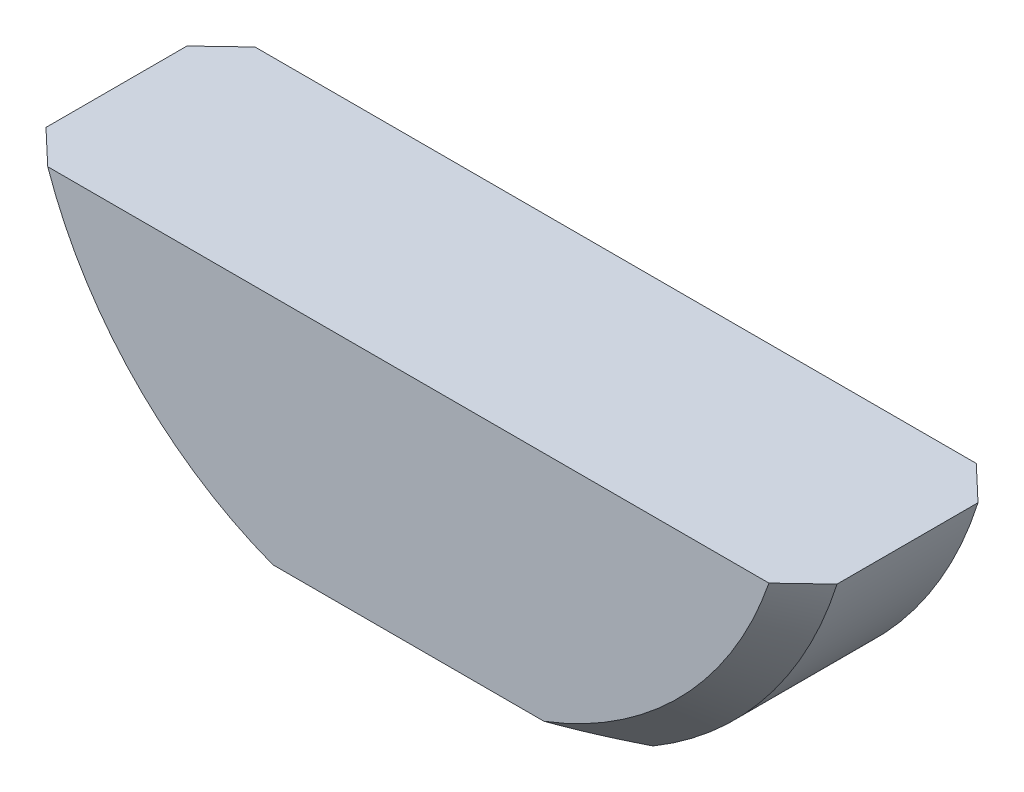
ISO-10303-21;
HEADER;
FILE_DESCRIPTION(('STEP AP214'),'2;1');
FILE_NAME('part.step','',(''),(''),'','','');
FILE_SCHEMA(('AUTOMOTIVE_DESIGN { 1 0 10303 214 1 1 1 1 }'));
ENDSEC;
DATA;
#1=APPLICATION_CONTEXT('core data for automotive mechanical design processes');
#2=APPLICATION_PROTOCOL_DEFINITION('international standard','automotive_design',2000,#1);
#3=PRODUCT_CONTEXT('',#1,'mechanical');
#4=PRODUCT('Part','Part','',(#3));
#5=PRODUCT_RELATED_PRODUCT_CATEGORY('part','',(#4));
#6=PRODUCT_DEFINITION_FORMATION('','',#4);
#7=PRODUCT_DEFINITION_CONTEXT('part definition',#1,'design');
#8=PRODUCT_DEFINITION('design','',#6,#7);
#9=PRODUCT_DEFINITION_SHAPE('','',#8);
#10=(LENGTH_UNIT() NAMED_UNIT(*) SI_UNIT(.MILLI.,.METRE.));
#11=(NAMED_UNIT(*) PLANE_ANGLE_UNIT() SI_UNIT($,.RADIAN.));
#12=(NAMED_UNIT(*) SI_UNIT($,.STERADIAN.) SOLID_ANGLE_UNIT());
#13=UNCERTAINTY_MEASURE_WITH_UNIT(LENGTH_MEASURE(1.E-05),#10,'distance_accuracy_value','');
#14=(GEOMETRIC_REPRESENTATION_CONTEXT(3) GLOBAL_UNCERTAINTY_ASSIGNED_CONTEXT((#13)) GLOBAL_UNIT_ASSIGNED_CONTEXT((#10,
#11,#12)) REPRESENTATION_CONTEXT('',''));
#15=CARTESIAN_POINT('',(0.,0.,0.));
#16=DIRECTION('',(0.,0.,1.));
#17=DIRECTION('',(1.,0.,0.));
#18=AXIS2_PLACEMENT_3D('',#15,#16,#17);
#19=CARTESIAN_POINT('',(0.,0.6,1.));
#20=DIRECTION('',(0.,0.,-1.));
#21=DIRECTION('',(-1.,0.,0.));
#22=AXIS2_PLACEMENT_3D('',#19,#20,#21);
#23=CYLINDRICAL_SURFACE('',#22,2.);
#24=DIRECTION('',(0.,0.,-1.));
#25=VECTOR('',#24,1.);
#26=CARTESIAN_POINT('',(1.02058806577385,-1.12,1.));
#27=LINE('',#26,#25);
#28=CARTESIAN_POINT('',(1.02058806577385,-1.12,0.839999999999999));
#29=VERTEX_POINT('',#28);
#30=CARTESIAN_POINT('',(1.02058806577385,-1.12,0.16));
#31=VERTEX_POINT('',#30);
#32=EDGE_CURVE('E126',#29,#31,#27,.T.);
#33=ORIENTED_EDGE('',*,*,#32,.T.);
#34=CARTESIAN_POINT('',(0.,0.6,0.16));
#35=DIRECTION('',(0.,0.,1.));
#36=DIRECTION('',(1.,0.,0.));
#37=AXIS2_PLACEMENT_3D('',#34,#35,#36);
#38=CIRCLE('',#37,2.);
#39=CARTESIAN_POINT('',(1.90787840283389,0.,0.16));
#40=VERTEX_POINT('',#39);
#41=EDGE_CURVE('E212',#31,#40,#38,.T.);
#42=ORIENTED_EDGE('',*,*,#41,.T.);
#43=DIRECTION('',(0.,0.,-1.));
#44=VECTOR('',#43,1.);
#45=CARTESIAN_POINT('',(1.90787840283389,0.,1.));
#46=LINE('',#45,#44);
#47=CARTESIAN_POINT('',(1.90787840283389,0.,0.839999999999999));
#48=VERTEX_POINT('',#47);
#49=EDGE_CURVE('E140',#48,#40,#46,.T.);
#50=ORIENTED_EDGE('',*,*,#49,.F.);
#51=CARTESIAN_POINT('',(0.,0.6,0.839999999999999));
#52=DIRECTION('',(0.,0.,1.));
#53=DIRECTION('',(1.,0.,0.));
#54=AXIS2_PLACEMENT_3D('',#51,#52,#53);
#55=CIRCLE('',#54,2.);
#56=EDGE_CURVE('E214',#48,#29,#55,.F.);
#57=ORIENTED_EDGE('',*,*,#56,.T.);
#58=EDGE_LOOP('',(#33,#42,#50,#57));
#59=FACE_BOUND('',#58,.T.);
#60=ADVANCED_FACE('F32',(#59),#23,.T.);
#61=DIRECTION('',(0.,0.,-1.));
#62=VECTOR('',#61,1.);
#63=CARTESIAN_POINT('',(-1.90787840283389,0.,1.));
#64=LINE('',#63,#62);
#65=CARTESIAN_POINT('',(-1.90787840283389,0.,0.84));
#66=VERTEX_POINT('',#65);
#67=CARTESIAN_POINT('',(-1.90787840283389,0.,0.16));
#68=VERTEX_POINT('',#67);
#69=EDGE_CURVE('E120',#66,#68,#64,.T.);
#70=ORIENTED_EDGE('',*,*,#69,.T.);
#71=CARTESIAN_POINT('',(0.,0.6,0.16));
#72=DIRECTION('',(0.,0.,1.));
#73=DIRECTION('',(1.,0.,0.));
#74=AXIS2_PLACEMENT_3D('',#71,#72,#73);
#75=CIRCLE('',#74,2.);
#76=CARTESIAN_POINT('',(-1.02058806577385,-1.12,0.16));
#77=VERTEX_POINT('',#76);
#78=EDGE_CURVE('E104',#68,#77,#75,.T.);
#79=ORIENTED_EDGE('',*,*,#78,.T.);
#80=DIRECTION('',(0.,0.,-1.));
#81=VECTOR('',#80,1.);
#82=CARTESIAN_POINT('',(-1.02058806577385,-1.12,1.));
#83=LINE('',#82,#81);
#84=CARTESIAN_POINT('',(-1.02058806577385,-1.12,0.84));
#85=VERTEX_POINT('',#84);
#86=EDGE_CURVE('E117',#77,#85,#83,.F.);
#87=ORIENTED_EDGE('',*,*,#86,.T.);
#88=CARTESIAN_POINT('',(0.,0.6,0.84));
#89=DIRECTION('',(0.,0.,1.));
#90=DIRECTION('',(1.,0.,0.));
#91=AXIS2_PLACEMENT_3D('',#88,#89,#90);
#92=CIRCLE('',#91,2.);
#93=EDGE_CURVE('E122',#85,#66,#92,.F.);
#94=ORIENTED_EDGE('',*,*,#93,.T.);
#95=EDGE_LOOP('',(#70,#79,#87,#94));
#96=FACE_BOUND('',#95,.T.);
#97=ADVANCED_FACE('F116',(#96),#23,.T.);
#98=CARTESIAN_POINT('',(-1.90787840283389,0.,1.));
#99=DIRECTION('',(0.,-1.,0.));
#100=DIRECTION('',(1.,0.,0.));
#101=AXIS2_PLACEMENT_3D('',#98,#99,#100);
#102=PLANE('',#101);
#103=DIRECTION('',(-1.,0.,0.));
#104=VECTOR('',#103,1.);
#105=CARTESIAN_POINT('',(-1.90787840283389,0.,0.));
#106=LINE('',#105,#104);
#107=CARTESIAN_POINT('',(1.73942519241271,0.,0.));
#108=VERTEX_POINT('',#107);
#109=CARTESIAN_POINT('',(-1.73942519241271,0.,0.));
#110=VERTEX_POINT('',#109);
#111=EDGE_CURVE('E133',#108,#110,#106,.T.);
#112=ORIENTED_EDGE('',*,*,#111,.T.);
#113=CARTESIAN_POINT('',(-1.73942519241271,0.,0.));
#114=CARTESIAN_POINT('',(-1.76756090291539,0.,0.0266033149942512));
#115=CARTESIAN_POINT('',(-1.79566652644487,0.,0.0532383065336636));
#116=CARTESIAN_POINT('',(-1.85181759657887,0.,0.106571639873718));
#117=CARTESIAN_POINT('',(-1.87986304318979,0.,0.133269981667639));
#118=CARTESIAN_POINT('',(-1.90787840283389,0.,0.16));
#119=B_SPLINE_CURVE_WITH_KNOTS('',3,(#113,#114,#115,#116,#117,#118),.UNSPECIFIED.,.F.,.F.,(4,2,
4),(0.,0.116164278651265,0.232328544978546),.UNSPECIFIED.);
#120=EDGE_CURVE('E188',#110,#68,#119,.T.);
#121=ORIENTED_EDGE('',*,*,#120,.T.);
#122=ORIENTED_EDGE('',*,*,#69,.F.);
#123=CARTESIAN_POINT('',(-1.90787840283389,0.,0.84));
#124=CARTESIAN_POINT('',(-1.87986304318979,0.,0.866730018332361));
#125=CARTESIAN_POINT('',(-1.85181759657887,0.,0.893428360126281));
#126=CARTESIAN_POINT('',(-1.79566652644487,0.,0.946761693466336));
#127=CARTESIAN_POINT('',(-1.76756090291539,0.,0.973396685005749));
#128=CARTESIAN_POINT('',(-1.73942519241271,0.,1.));
#129=B_SPLINE_CURVE_WITH_KNOTS('',3,(#123,#124,#125,#126,#127,#128),.UNSPECIFIED.,.F.,.F.,(4,2,
4),(0.,0.116164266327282,0.232328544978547),.UNSPECIFIED.);
#130=CARTESIAN_POINT('',(-1.73942519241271,0.,1.));
#131=VERTEX_POINT('',#130);
#132=EDGE_CURVE('E202',#66,#131,#129,.T.);
#133=ORIENTED_EDGE('',*,*,#132,.T.);
#134=DIRECTION('',(-1.,0.,0.));
#135=VECTOR('',#134,1.);
#136=CARTESIAN_POINT('',(-1.90787840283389,0.,1.));
#137=LINE('',#136,#135);
#138=CARTESIAN_POINT('',(1.73942519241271,0.,1.));
#139=VERTEX_POINT('',#138);
#140=EDGE_CURVE('E134',#139,#131,#137,.T.);
#141=ORIENTED_EDGE('',*,*,#140,.F.);
#142=CARTESIAN_POINT('',(1.73942519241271,0.,1.));
#143=CARTESIAN_POINT('',(1.76756090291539,0.,0.973396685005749));
#144=CARTESIAN_POINT('',(1.79566652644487,0.,0.946761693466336));
#145=CARTESIAN_POINT('',(1.85181759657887,0.,0.893428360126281));
#146=CARTESIAN_POINT('',(1.87986304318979,0.,0.86673001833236));
#147=CARTESIAN_POINT('',(1.90787840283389,0.,0.839999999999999));
#148=B_SPLINE_CURVE_WITH_KNOTS('',3,(#142,#143,#144,#145,#146,#147),.UNSPECIFIED.,.F.,.F.,(4,2,
4),(0.,0.116164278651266,0.232328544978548),.UNSPECIFIED.);
#149=EDGE_CURVE('E56',#139,#48,#148,.T.);
#150=ORIENTED_EDGE('',*,*,#149,.T.);
#151=ORIENTED_EDGE('',*,*,#49,.T.);
#152=CARTESIAN_POINT('',(1.90787840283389,0.,0.16));
#153=CARTESIAN_POINT('',(1.87986304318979,0.,0.133269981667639));
#154=CARTESIAN_POINT('',(1.85181759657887,0.,0.106571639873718));
#155=CARTESIAN_POINT('',(1.79566652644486,0.,0.0532383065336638));
#156=CARTESIAN_POINT('',(1.76756090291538,0.,0.0266033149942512));
#157=CARTESIAN_POINT('',(1.73942519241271,0.,0.));
#158=B_SPLINE_CURVE_WITH_KNOTS('',3,(#152,#153,#154,#155,#156,#157),.UNSPECIFIED.,.F.,.F.,(4,2,
4),(0.,0.116164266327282,0.232328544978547),.UNSPECIFIED.);
#159=EDGE_CURVE('E48',#40,#108,#158,.T.);
#160=ORIENTED_EDGE('',*,*,#159,.T.);
#161=EDGE_LOOP('',(#112,#121,#122,#133,#141,#150,#151,#160));
#162=FACE_BOUND('',#161,.T.);
#163=ADVANCED_FACE('F197',(#162),#102,.F.);
#164=CARTESIAN_POINT('',(0.,0.6,1.));
#165=DIRECTION('',(0.,0.,1.));
#166=DIRECTION('',(1.,0.,0.));
#167=AXIS2_PLACEMENT_3D('',#164,#165,#166);
#168=PLANE('',#167);
#169=DIRECTION('',(-1.,0.,0.));
#170=VECTOR('',#169,1.);
#171=CARTESIAN_POINT('',(0.,-1.12,1.));
#172=LINE('',#171,#170);
#173=CARTESIAN_POINT('',(0.653605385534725,-1.12,1.));
#174=VERTEX_POINT('',#173);
#175=CARTESIAN_POINT('',(-0.653605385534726,-1.12,1.));
#176=VERTEX_POINT('',#175);
#177=EDGE_CURVE('E129',#174,#176,#172,.T.);
#178=ORIENTED_EDGE('',*,*,#177,.F.);
#179=CARTESIAN_POINT('',(0.,0.6,1.));
#180=DIRECTION('',(0.,0.,1.));
#181=DIRECTION('',(1.,0.,0.));
#182=AXIS2_PLACEMENT_3D('',#179,#180,#181);
#183=CIRCLE('',#182,1.84);
#184=EDGE_CURVE('E11',#174,#139,#183,.T.);
#185=ORIENTED_EDGE('',*,*,#184,.T.);
#186=ORIENTED_EDGE('',*,*,#140,.T.);
#187=CARTESIAN_POINT('',(0.,0.6,1.));
#188=DIRECTION('',(0.,0.,1.));
#189=DIRECTION('',(1.,0.,0.));
#190=AXIS2_PLACEMENT_3D('',#187,#188,#189);
#191=CIRCLE('',#190,1.84);
#192=EDGE_CURVE('E41',#131,#176,#191,.T.);
#193=ORIENTED_EDGE('',*,*,#192,.T.);
#194=EDGE_LOOP('',(#178,#185,#186,#193));
#195=FACE_BOUND('',#194,.T.);
#196=ADVANCED_FACE('F159',(#195),#168,.T.);
#197=CARTESIAN_POINT('',(0.,0.6,0.));
#198=DIRECTION('',(0.,0.,1.));
#199=DIRECTION('',(1.,0.,0.));
#200=AXIS2_PLACEMENT_3D('',#197,#198,#199);
#201=PLANE('',#200);
#202=DIRECTION('',(-1.,0.,0.));
#203=VECTOR('',#202,1.);
#204=CARTESIAN_POINT('',(0.,-1.12,0.));
#205=LINE('',#204,#203);
#206=CARTESIAN_POINT('',(0.653605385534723,-1.12,0.));
#207=VERTEX_POINT('',#206);
#208=CARTESIAN_POINT('',(-0.653605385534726,-1.12,0.));
#209=VERTEX_POINT('',#208);
#210=EDGE_CURVE('E142',#207,#209,#205,.T.);
#211=ORIENTED_EDGE('',*,*,#210,.T.);
#212=CARTESIAN_POINT('',(0.,0.6,0.));
#213=DIRECTION('',(0.,0.,1.));
#214=DIRECTION('',(1.,0.,0.));
#215=AXIS2_PLACEMENT_3D('',#212,#213,#214);
#216=CIRCLE('',#215,1.84);
#217=EDGE_CURVE('E105',#209,#110,#216,.F.);
#218=ORIENTED_EDGE('',*,*,#217,.T.);
#219=ORIENTED_EDGE('',*,*,#111,.F.);
#220=CARTESIAN_POINT('',(0.,0.6,0.));
#221=DIRECTION('',(0.,0.,1.));
#222=DIRECTION('',(1.,0.,0.));
#223=AXIS2_PLACEMENT_3D('',#220,#221,#222);
#224=CIRCLE('',#223,1.84);
#225=EDGE_CURVE('E110',#108,#207,#224,.F.);
#226=ORIENTED_EDGE('',*,*,#225,.T.);
#227=EDGE_LOOP('',(#211,#218,#219,#226));
#228=FACE_BOUND('',#227,.T.);
#229=ADVANCED_FACE('F158',(#228),#201,.F.);
#230=CARTESIAN_POINT('',(-1.90787840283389,-1.12,5.23211238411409));
#231=DIRECTION('',(0.,1.,0.));
#232=DIRECTION('',(-1.,0.,0.));
#233=AXIS2_PLACEMENT_3D('',#230,#231,#232);
#234=PLANE('',#233);
#235=ORIENTED_EDGE('',*,*,#86,.F.);
#236=CARTESIAN_POINT('',(-1.02058806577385,-1.12,0.16));
#237=CARTESIAN_POINT('',(-0.990837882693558,-1.12,0.144820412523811));
#238=CARTESIAN_POINT('',(-0.960887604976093,-1.12,0.13002619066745));
#239=CARTESIAN_POINT('',(-0.900600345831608,-1.12,0.101333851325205));
#240=CARTESIAN_POINT('',(-0.870263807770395,-1.12,0.0874348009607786));
#241=CARTESIAN_POINT('',(-0.809150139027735,-1.12,0.0606236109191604));
#242=CARTESIAN_POINT('',(-0.778372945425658,-1.12,0.0477116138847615));
#243=CARTESIAN_POINT('',(-0.716341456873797,-1.12,0.0229911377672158));
#244=CARTESIAN_POINT('',(-0.68508669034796,-1.12,0.0111838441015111));
#245=CARTESIAN_POINT('',(-0.653605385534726,-1.12,0.));
#246=B_SPLINE_CURVE_WITH_KNOTS('',3,(#236,#237,#238,#239,#240,#241,#242,#243,#244,#245),
.UNSPECIFIED.,.F.,.F.,(4,2,2,2,4),(0.,0.100198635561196,0.200291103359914,0.300398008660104,
0.400611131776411),.UNSPECIFIED.);
#247=EDGE_CURVE('E100',#77,#209,#246,.T.);
#248=ORIENTED_EDGE('',*,*,#247,.T.);
#249=ORIENTED_EDGE('',*,*,#210,.F.);
#250=CARTESIAN_POINT('',(0.653605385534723,-1.12,0.));
#251=CARTESIAN_POINT('',(0.685086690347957,-1.12,0.011183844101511));
#252=CARTESIAN_POINT('',(0.716341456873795,-1.12,0.0229911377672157));
#253=CARTESIAN_POINT('',(0.778372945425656,-1.12,0.0477116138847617));
#254=CARTESIAN_POINT('',(0.809150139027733,-1.12,0.0606236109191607));
#255=CARTESIAN_POINT('',(0.870263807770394,-1.12,0.0874348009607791));
#256=CARTESIAN_POINT('',(0.900600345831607,-1.12,0.101333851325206));
#257=CARTESIAN_POINT('',(0.960887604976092,-1.12,0.130026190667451));
#258=CARTESIAN_POINT('',(0.990837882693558,-1.12,0.144820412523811));
#259=CARTESIAN_POINT('',(1.02058806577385,-1.12,0.16));
#260=B_SPLINE_CURVE_WITH_KNOTS('',3,(#250,#251,#252,#253,#254,#255,#256,#257,#258,#259),
.UNSPECIFIED.,.F.,.F.,(4,2,2,2,4),(0.,0.100213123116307,0.200320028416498,0.300412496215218,
0.400611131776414),.UNSPECIFIED.);
#261=EDGE_CURVE('E111',#207,#31,#260,.T.);
#262=ORIENTED_EDGE('',*,*,#261,.T.);
#263=ORIENTED_EDGE('',*,*,#32,.F.);
#264=CARTESIAN_POINT('',(1.02058806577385,-1.12,0.839999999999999));
#265=CARTESIAN_POINT('',(0.990837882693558,-1.12,0.855179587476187));
#266=CARTESIAN_POINT('',(0.960887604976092,-1.12,0.869973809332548));
#267=CARTESIAN_POINT('',(0.900600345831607,-1.12,0.898666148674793));
#268=CARTESIAN_POINT('',(0.870263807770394,-1.12,0.91256519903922));
#269=CARTESIAN_POINT('',(0.809150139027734,-1.12,0.939376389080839));
#270=CARTESIAN_POINT('',(0.778372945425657,-1.12,0.952288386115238));
#271=CARTESIAN_POINT('',(0.716341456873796,-1.12,0.977008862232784));
#272=CARTESIAN_POINT('',(0.685086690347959,-1.12,0.988816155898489));
#273=CARTESIAN_POINT('',(0.653605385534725,-1.12,1.));
#274=B_SPLINE_CURVE_WITH_KNOTS('',3,(#264,#265,#266,#267,#268,#269,#270,#271,#272,#273),
.UNSPECIFIED.,.F.,.F.,(4,2,2,2,4),(0.,0.100198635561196,0.200291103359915,0.300398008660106,
0.400611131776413),.UNSPECIFIED.);
#275=EDGE_CURVE('E150',#29,#174,#274,.T.);
#276=ORIENTED_EDGE('',*,*,#275,.T.);
#277=ORIENTED_EDGE('',*,*,#177,.T.);
#278=CARTESIAN_POINT('',(-0.653605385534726,-1.12,1.));
#279=CARTESIAN_POINT('',(-0.685086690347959,-1.12,0.988816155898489));
#280=CARTESIAN_POINT('',(-0.716341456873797,-1.12,0.977008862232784));
#281=CARTESIAN_POINT('',(-0.778372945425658,-1.12,0.952288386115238));
#282=CARTESIAN_POINT('',(-0.809150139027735,-1.12,0.939376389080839));
#283=CARTESIAN_POINT('',(-0.870263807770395,-1.12,0.912565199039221));
#284=CARTESIAN_POINT('',(-0.900600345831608,-1.12,0.898666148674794));
#285=CARTESIAN_POINT('',(-0.960887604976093,-1.12,0.869973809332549));
#286=CARTESIAN_POINT('',(-0.990837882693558,-1.12,0.855179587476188));
#287=CARTESIAN_POINT('',(-1.02058806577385,-1.12,0.84));
#288=B_SPLINE_CURVE_WITH_KNOTS('',3,(#278,#279,#280,#281,#282,#283,#284,#285,#286,#287),
.UNSPECIFIED.,.F.,.F.,(4,2,2,2,4),(0.,0.100213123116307,0.200320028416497,0.300412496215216,
0.400611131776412),.UNSPECIFIED.);
#289=EDGE_CURVE('E121',#176,#85,#288,.T.);
#290=ORIENTED_EDGE('',*,*,#289,.T.);
#291=EDGE_LOOP('',(#235,#248,#249,#262,#263,#276,#277,#290));
#292=FACE_BOUND('',#291,.T.);
#293=ADVANCED_FACE('F124',(#292),#234,.F.);
#294=CARTESIAN_POINT('',(0.,0.6,0.16));
#295=DIRECTION('',(0.,0.,1.));
#296=DIRECTION('',(1.,0.,0.));
#297=AXIS2_PLACEMENT_3D('',#294,#295,#296);
#298=CONICAL_SURFACE('',#297,2.,0.78539816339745);
#299=ORIENTED_EDGE('',*,*,#120,.F.);
#300=ORIENTED_EDGE('',*,*,#217,.F.);
#301=ORIENTED_EDGE('',*,*,#247,.F.);
#302=ORIENTED_EDGE('',*,*,#78,.F.);
#303=EDGE_LOOP('',(#299,#300,#301,#302));
#304=FACE_BOUND('',#303,.T.);
#305=ADVANCED_FACE('F103',(#304),#298,.T.);
#306=CARTESIAN_POINT('',(0.,0.6,0.16));
#307=DIRECTION('',(0.,0.,1.));
#308=DIRECTION('',(1.,0.,0.));
#309=AXIS2_PLACEMENT_3D('',#306,#307,#308);
#310=CONICAL_SURFACE('',#309,2.,0.785398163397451);
#311=ORIENTED_EDGE('',*,*,#261,.F.);
#312=ORIENTED_EDGE('',*,*,#225,.F.);
#313=ORIENTED_EDGE('',*,*,#159,.F.);
#314=ORIENTED_EDGE('',*,*,#41,.F.);
#315=EDGE_LOOP('',(#311,#312,#313,#314));
#316=FACE_BOUND('',#315,.T.);
#317=ADVANCED_FACE('F173',(#316),#310,.T.);
#318=CARTESIAN_POINT('',(0.,0.6,1.));
#319=DIRECTION('',(0.,0.,-1.));
#320=DIRECTION('',(-1.,0.,0.));
#321=AXIS2_PLACEMENT_3D('',#318,#319,#320);
#322=CONICAL_SURFACE('',#321,1.84,0.785398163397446);
#323=ORIENTED_EDGE('',*,*,#275,.F.);
#324=ORIENTED_EDGE('',*,*,#56,.F.);
#325=ORIENTED_EDGE('',*,*,#149,.F.);
#326=ORIENTED_EDGE('',*,*,#184,.F.);
#327=EDGE_LOOP('',(#323,#324,#325,#326));
#328=FACE_BOUND('',#327,.T.);
#329=ADVANCED_FACE('F176',(#328),#322,.T.);
#330=CARTESIAN_POINT('',(0.,0.6,1.));
#331=DIRECTION('',(0.,0.,-1.));
#332=DIRECTION('',(-1.,0.,0.));
#333=AXIS2_PLACEMENT_3D('',#330,#331,#332);
#334=CONICAL_SURFACE('',#333,1.84,0.785398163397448);
#335=ORIENTED_EDGE('',*,*,#132,.F.);
#336=ORIENTED_EDGE('',*,*,#93,.F.);
#337=ORIENTED_EDGE('',*,*,#289,.F.);
#338=ORIENTED_EDGE('',*,*,#192,.F.);
#339=EDGE_LOOP('',(#335,#336,#337,#338));
#340=FACE_BOUND('',#339,.T.);
#341=ADVANCED_FACE('F34',(#340),#334,.T.);
#342=CLOSED_SHELL('',(#60,#97,#163,#196,#229,#293,#305,#317,#329,#341));
#343=MANIFOLD_SOLID_BREP('B2',#342);
#344=ADVANCED_BREP_SHAPE_REPRESENTATION('',(#18,#343),#14);
#345=SHAPE_DEFINITION_REPRESENTATION(#9,#344);
ENDSEC;
END-ISO-10303-21;
